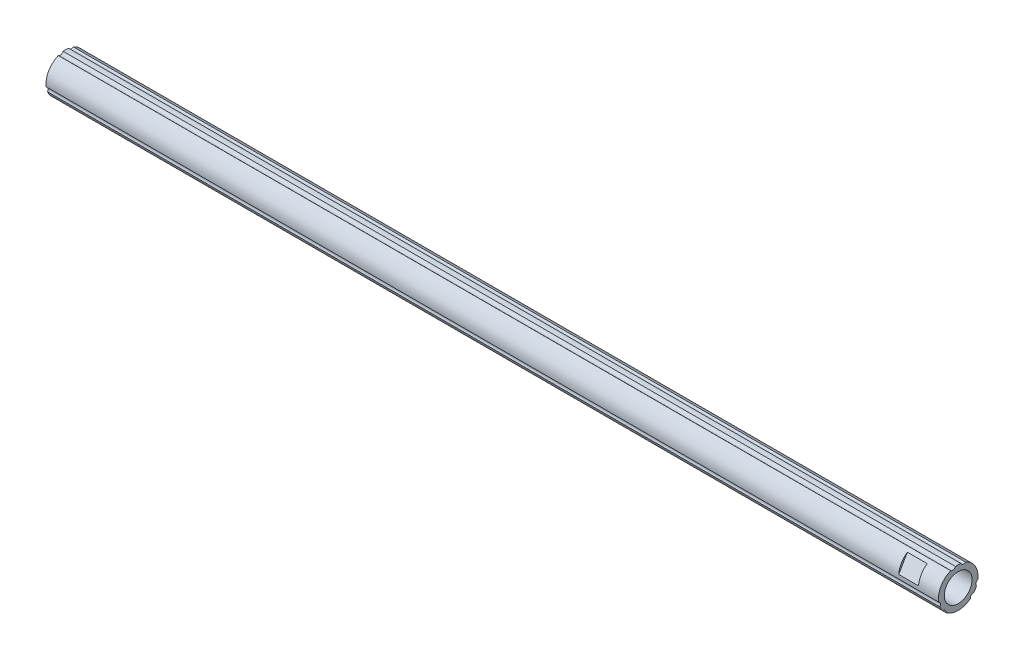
ISO-10303-21;
HEADER;
FILE_DESCRIPTION(('STEP AP214'),'2;1');
FILE_NAME('part.step','',(''),(''),'','','');
FILE_SCHEMA(('AUTOMOTIVE_DESIGN { 1 0 10303 214 1 1 1 1 }'));
ENDSEC;
DATA;
#1=APPLICATION_CONTEXT('core data for automotive mechanical design processes');
#2=APPLICATION_PROTOCOL_DEFINITION('international standard','automotive_design',2000,#1);
#3=PRODUCT_CONTEXT('',#1,'mechanical');
#4=PRODUCT('Part','Part','',(#3));
#5=PRODUCT_RELATED_PRODUCT_CATEGORY('part','',(#4));
#6=PRODUCT_DEFINITION_FORMATION('','',#4);
#7=PRODUCT_DEFINITION_CONTEXT('part definition',#1,'design');
#8=PRODUCT_DEFINITION('design','',#6,#7);
#9=PRODUCT_DEFINITION_SHAPE('','',#8);
#10=(LENGTH_UNIT() NAMED_UNIT(*) SI_UNIT(.MILLI.,.METRE.));
#11=(NAMED_UNIT(*) PLANE_ANGLE_UNIT() SI_UNIT($,.RADIAN.));
#12=(NAMED_UNIT(*) SI_UNIT($,.STERADIAN.) SOLID_ANGLE_UNIT());
#13=UNCERTAINTY_MEASURE_WITH_UNIT(LENGTH_MEASURE(1.E-05),#10,'distance_accuracy_value','');
#14=(GEOMETRIC_REPRESENTATION_CONTEXT(3) GLOBAL_UNCERTAINTY_ASSIGNED_CONTEXT((#13)) GLOBAL_UNIT_ASSIGNED_CONTEXT((#10,
#11,#12)) REPRESENTATION_CONTEXT('',''));
#15=CARTESIAN_POINT('',(0.,0.,0.));
#16=DIRECTION('',(0.,0.,1.));
#17=DIRECTION('',(1.,0.,0.));
#18=AXIS2_PLACEMENT_3D('',#15,#16,#17);
#19=CARTESIAN_POINT('',(233.143551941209,-11.7362954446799,450.));
#20=DIRECTION('',(-1.,0.,0.));
#21=DIRECTION('',(0.,0.,1.));
#22=AXIS2_PLACEMENT_3D('',#19,#20,#21);
#23=CYLINDRICAL_SURFACE('',#22,10.);
#24=DIRECTION('',(-1.,0.,0.));
#25=VECTOR('',#24,1.);
#26=CARTESIAN_POINT('',(233.143551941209,-2.47658612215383,453.775947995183));
#27=LINE('',#26,#25);
#28=CARTESIAN_POINT('',(233.143551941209,-2.47658612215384,453.775947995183));
#29=VERTEX_POINT('',#28);
#30=CARTESIAN_POINT('',(-216.856448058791,-2.47658612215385,453.775947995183));
#31=VERTEX_POINT('',#30);
#32=EDGE_CURVE('E250',#29,#31,#27,.T.);
#33=ORIENTED_EDGE('',*,*,#32,.T.);
#34=CARTESIAN_POINT('',(-216.856448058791,-11.7362954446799,450.));
#35=DIRECTION('',(1.,0.,0.));
#36=DIRECTION('',(0.,0.,-1.));
#37=AXIS2_PLACEMENT_3D('',#34,#35,#36);
#38=CIRCLE('',#37,10.);
#39=CARTESIAN_POINT('',(-216.856448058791,-13.0960832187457,459.907117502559));
#40=VERTEX_POINT('',#39);
#41=EDGE_CURVE('E233',#31,#40,#38,.T.);
#42=ORIENTED_EDGE('',*,*,#41,.T.);
#43=DIRECTION('',(1.,0.,0.));
#44=VECTOR('',#43,1.);
#45=CARTESIAN_POINT('',(233.143551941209,-13.0960832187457,459.907117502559));
#46=LINE('',#45,#44);
#47=CARTESIAN_POINT('',(233.143551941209,-13.0960832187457,459.907117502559));
#48=VERTEX_POINT('',#47);
#49=EDGE_CURVE('E96',#40,#48,#46,.T.);
#50=ORIENTED_EDGE('',*,*,#49,.T.);
#51=CARTESIAN_POINT('',(233.143551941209,-11.7362954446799,450.));
#52=DIRECTION('',(-1.,0.,0.));
#53=DIRECTION('',(0.,0.,1.));
#54=AXIS2_PLACEMENT_3D('',#51,#52,#53);
#55=CIRCLE('',#54,10.);
#56=EDGE_CURVE('E107',#48,#29,#55,.T.);
#57=ORIENTED_EDGE('',*,*,#56,.T.);
#58=EDGE_LOOP('',(#33,#42,#50,#57));
#59=FACE_BOUND('',#58,.T.);
#60=DIRECTION('',(-1.,0.,0.));
#61=VECTOR('',#60,1.);
#62=CARTESIAN_POINT('',(233.143551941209,-11.0112126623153,459.97367810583));
#63=LINE('',#62,#61);
#64=CARTESIAN_POINT('',(213.143551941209,-11.0112126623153,459.97367810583));
#65=VERTEX_POINT('',#64);
#66=CARTESIAN_POINT('',(223.143551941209,-11.0112126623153,459.97367810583));
#67=VERTEX_POINT('',#66);
#68=EDGE_CURVE('E26',#65,#67,#63,.F.);
#69=ORIENTED_EDGE('',*,*,#68,.F.);
#70=CARTESIAN_POINT('',(213.143551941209,-11.7362954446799,450.));
#71=DIRECTION('',(1.,0.,0.));
#72=DIRECTION('',(0.,0.,-1.));
#73=AXIS2_PLACEMENT_3D('',#70,#71,#72);
#74=CIRCLE('',#73,10.);
#75=CARTESIAN_POINT('',(213.143551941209,-3.46137822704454,455.61477916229));
#76=VERTEX_POINT('',#75);
#77=EDGE_CURVE('E11',#65,#76,#74,.F.);
#78=ORIENTED_EDGE('',*,*,#77,.T.);
#79=DIRECTION('',(-1.,0.,0.));
#80=VECTOR('',#79,1.);
#81=CARTESIAN_POINT('',(233.143551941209,-3.46137822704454,455.61477916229));
#82=LINE('',#81,#80);
#83=CARTESIAN_POINT('',(223.143551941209,-3.46137822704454,455.61477916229));
#84=VERTEX_POINT('',#83);
#85=EDGE_CURVE('E128',#84,#76,#82,.T.);
#86=ORIENTED_EDGE('',*,*,#85,.F.);
#87=CARTESIAN_POINT('',(223.143551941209,-11.7362954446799,450.));
#88=DIRECTION('',(1.,0.,0.));
#89=DIRECTION('',(0.,0.,-1.));
#90=AXIS2_PLACEMENT_3D('',#87,#88,#89);
#91=CIRCLE('',#90,10.);
#92=EDGE_CURVE('E125',#67,#84,#91,.F.);
#93=ORIENTED_EDGE('',*,*,#92,.F.);
#94=EDGE_LOOP('',(#69,#78,#86,#93));
#95=FACE_BOUND('',#94,.T.);
#96=ADVANCED_FACE('F17',(#59,#95),#23,.T.);
#97=CARTESIAN_POINT('',(233.143551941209,-1.20770393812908,452.821127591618));
#98=DIRECTION('',(1.,0.,0.));
#99=DIRECTION('',(0.,0.,-1.));
#100=AXIS2_PLACEMENT_3D('',#97,#98,#99);
#101=CYLINDRICAL_SURFACE('',#100,1.588);
#102=CARTESIAN_POINT('',(233.143551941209,-1.20770393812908,452.821127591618));
#103=DIRECTION('',(1.,0.,0.));
#104=DIRECTION('',(0.,0.,-1.));
#105=AXIS2_PLACEMENT_3D('',#102,#103,#104);
#106=CIRCLE('',#105,1.588);
#107=CARTESIAN_POINT('',(233.143551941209,-1.82917794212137,451.359787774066));
#108=VERTEX_POINT('',#107);
#109=EDGE_CURVE('E300',#29,#108,#106,.T.);
#110=ORIENTED_EDGE('',*,*,#109,.T.);
#111=DIRECTION('',(-1.,0.,0.));
#112=VECTOR('',#111,1.);
#113=CARTESIAN_POINT('',(233.143551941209,-1.82917794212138,451.359787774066));
#114=LINE('',#113,#112);
#115=CARTESIAN_POINT('',(-216.856448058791,-1.82917794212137,451.359787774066));
#116=VERTEX_POINT('',#115);
#117=EDGE_CURVE('E121',#116,#108,#114,.F.);
#118=ORIENTED_EDGE('',*,*,#117,.F.);
#119=CARTESIAN_POINT('',(-216.856448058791,-1.20770393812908,452.821127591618));
#120=DIRECTION('',(1.,0.,0.));
#121=DIRECTION('',(0.,0.,-1.));
#122=AXIS2_PLACEMENT_3D('',#119,#120,#121);
#123=CIRCLE('',#122,1.588);
#124=EDGE_CURVE('E237',#116,#31,#123,.F.);
#125=ORIENTED_EDGE('',*,*,#124,.T.);
#126=ORIENTED_EDGE('',*,*,#32,.F.);
#127=EDGE_LOOP('',(#110,#118,#125,#126));
#128=FACE_BOUND('',#127,.T.);
#129=ADVANCED_FACE('F19',(#128),#101,.F.);
#130=CARTESIAN_POINT('',(233.143551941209,-14.5574230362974,460.528591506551));
#131=DIRECTION('',(1.,0.,0.));
#132=DIRECTION('',(0.,0.,-1.));
#133=AXIS2_PLACEMENT_3D('',#130,#131,#132);
#134=CYLINDRICAL_SURFACE('',#133,1.588);
#135=CARTESIAN_POINT('',(233.143551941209,-14.5574230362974,460.528591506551));
#136=DIRECTION('',(1.,0.,0.));
#137=DIRECTION('',(0.,0.,-1.));
#138=AXIS2_PLACEMENT_3D('',#135,#136,#137);
#139=CIRCLE('',#138,1.588);
#140=CARTESIAN_POINT('',(233.143551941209,-15.5122434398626,459.259709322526));
#141=VERTEX_POINT('',#140);
#142=EDGE_CURVE('E86',#141,#48,#139,.T.);
#143=ORIENTED_EDGE('',*,*,#142,.T.);
#144=ORIENTED_EDGE('',*,*,#49,.F.);
#145=CARTESIAN_POINT('',(-216.856448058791,-14.5574230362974,460.528591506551));
#146=DIRECTION('',(1.,0.,0.));
#147=DIRECTION('',(0.,0.,-1.));
#148=AXIS2_PLACEMENT_3D('',#145,#146,#147);
#149=CIRCLE('',#148,1.588);
#150=CARTESIAN_POINT('',(-216.856448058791,-15.5122434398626,459.259709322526));
#151=VERTEX_POINT('',#150);
#152=EDGE_CURVE('E89',#40,#151,#149,.F.);
#153=ORIENTED_EDGE('',*,*,#152,.T.);
#154=DIRECTION('',(-1.,0.,0.));
#155=VECTOR('',#154,1.);
#156=CARTESIAN_POINT('',(233.143551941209,-15.5122434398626,459.259709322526));
#157=LINE('',#156,#155);
#158=EDGE_CURVE('E82',#141,#151,#157,.T.);
#159=ORIENTED_EDGE('',*,*,#158,.F.);
#160=EDGE_LOOP('',(#143,#144,#153,#159));
#161=FACE_BOUND('',#160,.T.);
#162=ADVANCED_FACE('F84',(#161),#134,.F.);
#163=CARTESIAN_POINT('',(233.143551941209,-11.7362954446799,450.));
#164=DIRECTION('',(-1.,0.,0.));
#165=DIRECTION('',(0.,0.,1.));
#166=AXIS2_PLACEMENT_3D('',#163,#164,#165);
#167=CYLINDRICAL_SURFACE('',#166,10.);
#168=ORIENTED_EDGE('',*,*,#158,.T.);
#169=CARTESIAN_POINT('',(-216.856448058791,-11.7362954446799,450.));
#170=DIRECTION('',(1.,0.,0.));
#171=DIRECTION('',(0.,0.,-1.));
#172=AXIS2_PLACEMENT_3D('',#169,#170,#171);
#173=CIRCLE('',#172,10.);
#174=CARTESIAN_POINT('',(-216.856448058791,-17.8674649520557,457.89992154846));
#175=VERTEX_POINT('',#174);
#176=EDGE_CURVE('E228',#151,#175,#173,.T.);
#177=ORIENTED_EDGE('',*,*,#176,.T.);
#178=DIRECTION('',(1.,0.,0.));
#179=VECTOR('',#178,1.);
#180=CARTESIAN_POINT('',(233.143551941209,-17.8674649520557,457.89992154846));
#181=LINE('',#180,#179);
#182=CARTESIAN_POINT('',(233.143551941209,-17.8674649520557,457.89992154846));
#183=VERTEX_POINT('',#182);
#184=EDGE_CURVE('E95',#175,#183,#181,.T.);
#185=ORIENTED_EDGE('',*,*,#184,.T.);
#186=CARTESIAN_POINT('',(233.143551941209,-11.7362954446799,450.));
#187=DIRECTION('',(-1.,0.,0.));
#188=DIRECTION('',(0.,0.,1.));
#189=AXIS2_PLACEMENT_3D('',#186,#187,#188);
#190=CIRCLE('',#189,10.);
#191=EDGE_CURVE('E103',#183,#141,#190,.T.);
#192=ORIENTED_EDGE('',*,*,#191,.T.);
#193=EDGE_LOOP('',(#168,#177,#185,#192));
#194=FACE_BOUND('',#193,.T.);
#195=ADVANCED_FACE('F110',(#194),#167,.T.);
#196=CARTESIAN_POINT('',(233.143551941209,-19.4437593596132,457.707463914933));
#197=DIRECTION('',(1.,0.,0.));
#198=DIRECTION('',(0.,0.,-1.));
#199=AXIS2_PLACEMENT_3D('',#196,#197,#198);
#200=CYLINDRICAL_SURFACE('',#199,1.588);
#201=CARTESIAN_POINT('',(233.143551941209,-19.4437593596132,457.707463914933));
#202=DIRECTION('',(1.,0.,0.));
#203=DIRECTION('',(0.,0.,-1.));
#204=AXIS2_PLACEMENT_3D('',#201,#202,#203);
#205=CIRCLE('',#204,1.588);
#206=CARTESIAN_POINT('',(233.143551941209,-19.63621699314,456.131169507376));
#207=VERTEX_POINT('',#206);
#208=EDGE_CURVE('E273',#207,#183,#205,.T.);
#209=ORIENTED_EDGE('',*,*,#208,.T.);
#210=ORIENTED_EDGE('',*,*,#184,.F.);
#211=CARTESIAN_POINT('',(-216.856448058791,-19.4437593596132,457.707463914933));
#212=DIRECTION('',(1.,0.,0.));
#213=DIRECTION('',(0.,0.,-1.));
#214=AXIS2_PLACEMENT_3D('',#211,#212,#213);
#215=CIRCLE('',#214,1.588);
#216=CARTESIAN_POINT('',(-216.856448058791,-19.63621699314,456.131169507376));
#217=VERTEX_POINT('',#216);
#218=EDGE_CURVE('E225',#175,#217,#215,.F.);
#219=ORIENTED_EDGE('',*,*,#218,.T.);
#220=DIRECTION('',(-1.,0.,0.));
#221=VECTOR('',#220,1.);
#222=CARTESIAN_POINT('',(233.143551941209,-19.63621699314,456.131169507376));
#223=LINE('',#222,#221);
#224=EDGE_CURVE('E41',#207,#217,#223,.T.);
#225=ORIENTED_EDGE('',*,*,#224,.F.);
#226=EDGE_LOOP('',(#209,#210,#219,#225));
#227=FACE_BOUND('',#226,.T.);
#228=ADVANCED_FACE('F310',(#227),#200,.F.);
#229=CARTESIAN_POINT('',(233.143551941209,-11.7362954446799,450.));
#230=DIRECTION('',(-1.,0.,0.));
#231=DIRECTION('',(0.,0.,1.));
#232=AXIS2_PLACEMENT_3D('',#229,#230,#231);
#233=CYLINDRICAL_SURFACE('',#232,10.);
#234=DIRECTION('',(1.,0.,0.));
#235=VECTOR('',#234,1.);
#236=CARTESIAN_POINT('',(233.143551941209,-19.63621699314,443.868830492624));
#237=LINE('',#236,#235);
#238=CARTESIAN_POINT('',(-216.856448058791,-19.63621699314,443.868830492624));
#239=VERTEX_POINT('',#238);
#240=CARTESIAN_POINT('',(233.143551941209,-19.63621699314,443.868830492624));
#241=VERTEX_POINT('',#240);
#242=EDGE_CURVE('E260',#239,#241,#237,.T.);
#243=ORIENTED_EDGE('',*,*,#242,.T.);
#244=CARTESIAN_POINT('',(233.143551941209,-11.7362954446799,450.));
#245=DIRECTION('',(-1.,0.,0.));
#246=DIRECTION('',(0.,0.,1.));
#247=AXIS2_PLACEMENT_3D('',#244,#245,#246);
#248=CIRCLE('',#247,10.);
#249=EDGE_CURVE('E276',#241,#207,#248,.T.);
#250=ORIENTED_EDGE('',*,*,#249,.T.);
#251=ORIENTED_EDGE('',*,*,#224,.T.);
#252=CARTESIAN_POINT('',(-216.856448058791,-11.7362954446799,450.));
#253=DIRECTION('',(1.,0.,0.));
#254=DIRECTION('',(0.,0.,-1.));
#255=AXIS2_PLACEMENT_3D('',#252,#253,#254);
#256=CIRCLE('',#255,10.);
#257=EDGE_CURVE('E221',#217,#239,#256,.T.);
#258=ORIENTED_EDGE('',*,*,#257,.T.);
#259=EDGE_LOOP('',(#243,#250,#251,#258));
#260=FACE_BOUND('',#259,.T.);
#261=ADVANCED_FACE('F313',(#260),#233,.T.);
#262=CARTESIAN_POINT('',(233.143551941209,-19.4437593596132,442.292536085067));
#263=DIRECTION('',(1.,0.,0.));
#264=DIRECTION('',(0.,0.,-1.));
#265=AXIS2_PLACEMENT_3D('',#262,#263,#264);
#266=CYLINDRICAL_SURFACE('',#265,1.588);
#267=CARTESIAN_POINT('',(233.143551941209,-19.4437593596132,442.292536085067));
#268=DIRECTION('',(1.,0.,0.));
#269=DIRECTION('',(0.,0.,-1.));
#270=AXIS2_PLACEMENT_3D('',#267,#268,#269);
#271=CIRCLE('',#270,1.588);
#272=CARTESIAN_POINT('',(233.143551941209,-17.8674649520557,442.10007845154));
#273=VERTEX_POINT('',#272);
#274=EDGE_CURVE('E280',#273,#241,#271,.T.);
#275=ORIENTED_EDGE('',*,*,#274,.T.);
#276=ORIENTED_EDGE('',*,*,#242,.F.);
#277=CARTESIAN_POINT('',(-216.856448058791,-19.4437593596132,442.292536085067));
#278=DIRECTION('',(1.,0.,0.));
#279=DIRECTION('',(0.,0.,-1.));
#280=AXIS2_PLACEMENT_3D('',#277,#278,#279);
#281=CIRCLE('',#280,1.588);
#282=CARTESIAN_POINT('',(-216.856448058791,-17.8674649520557,442.10007845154));
#283=VERTEX_POINT('',#282);
#284=EDGE_CURVE('E215',#239,#283,#281,.F.);
#285=ORIENTED_EDGE('',*,*,#284,.T.);
#286=DIRECTION('',(-1.,0.,0.));
#287=VECTOR('',#286,1.);
#288=CARTESIAN_POINT('',(233.143551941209,-17.8674649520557,442.10007845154));
#289=LINE('',#288,#287);
#290=EDGE_CURVE('E258',#273,#283,#289,.T.);
#291=ORIENTED_EDGE('',*,*,#290,.F.);
#292=EDGE_LOOP('',(#275,#276,#285,#291));
#293=FACE_BOUND('',#292,.T.);
#294=ADVANCED_FACE('F315',(#293),#266,.F.);
#295=CARTESIAN_POINT('',(233.143551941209,-11.7362954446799,450.));
#296=DIRECTION('',(-1.,0.,0.));
#297=DIRECTION('',(0.,0.,1.));
#298=AXIS2_PLACEMENT_3D('',#295,#296,#297);
#299=CYLINDRICAL_SURFACE('',#298,10.);
#300=DIRECTION('',(1.,0.,0.));
#301=VECTOR('',#300,1.);
#302=CARTESIAN_POINT('',(233.143551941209,-15.5122434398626,440.740290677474));
#303=LINE('',#302,#301);
#304=CARTESIAN_POINT('',(-216.856448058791,-15.5122434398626,440.740290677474));
#305=VERTEX_POINT('',#304);
#306=CARTESIAN_POINT('',(233.143551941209,-15.5122434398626,440.740290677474));
#307=VERTEX_POINT('',#306);
#308=EDGE_CURVE('E193',#305,#307,#303,.T.);
#309=ORIENTED_EDGE('',*,*,#308,.T.);
#310=CARTESIAN_POINT('',(233.143551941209,-11.7362954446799,450.));
#311=DIRECTION('',(-1.,0.,0.));
#312=DIRECTION('',(0.,0.,1.));
#313=AXIS2_PLACEMENT_3D('',#310,#311,#312);
#314=CIRCLE('',#313,10.);
#315=EDGE_CURVE('E284',#307,#273,#314,.T.);
#316=ORIENTED_EDGE('',*,*,#315,.T.);
#317=ORIENTED_EDGE('',*,*,#290,.T.);
#318=CARTESIAN_POINT('',(-216.856448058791,-11.7362954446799,450.));
#319=DIRECTION('',(1.,0.,0.));
#320=DIRECTION('',(0.,0.,-1.));
#321=AXIS2_PLACEMENT_3D('',#318,#319,#320);
#322=CIRCLE('',#321,10.);
#323=EDGE_CURVE('E209',#283,#305,#322,.T.);
#324=ORIENTED_EDGE('',*,*,#323,.T.);
#325=EDGE_LOOP('',(#309,#316,#317,#324));
#326=FACE_BOUND('',#325,.T.);
#327=ADVANCED_FACE('F317',(#326),#299,.T.);
#328=CARTESIAN_POINT('',(233.143551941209,-14.5574230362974,439.47140849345));
#329=DIRECTION('',(1.,0.,0.));
#330=DIRECTION('',(0.,0.,-1.));
#331=AXIS2_PLACEMENT_3D('',#328,#329,#330);
#332=CYLINDRICAL_SURFACE('',#331,1.588);
#333=CARTESIAN_POINT('',(233.143551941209,-14.5574230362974,439.47140849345));
#334=DIRECTION('',(1.,0.,0.));
#335=DIRECTION('',(0.,0.,-1.));
#336=AXIS2_PLACEMENT_3D('',#333,#334,#335);
#337=CIRCLE('',#336,1.588);
#338=CARTESIAN_POINT('',(233.143551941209,-13.0960832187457,440.092882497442));
#339=VERTEX_POINT('',#338);
#340=EDGE_CURVE('E287',#339,#307,#337,.T.);
#341=ORIENTED_EDGE('',*,*,#340,.T.);
#342=ORIENTED_EDGE('',*,*,#308,.F.);
#343=CARTESIAN_POINT('',(-216.856448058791,-14.5574230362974,439.47140849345));
#344=DIRECTION('',(1.,0.,0.));
#345=DIRECTION('',(0.,0.,-1.));
#346=AXIS2_PLACEMENT_3D('',#343,#344,#345);
#347=CIRCLE('',#346,1.588);
#348=CARTESIAN_POINT('',(-216.856448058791,-13.0960832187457,440.092882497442));
#349=VERTEX_POINT('',#348);
#350=EDGE_CURVE('E200',#305,#349,#347,.F.);
#351=ORIENTED_EDGE('',*,*,#350,.T.);
#352=DIRECTION('',(-1.,0.,0.));
#353=VECTOR('',#352,1.);
#354=CARTESIAN_POINT('',(233.143551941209,-13.0960832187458,440.092882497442));
#355=LINE('',#354,#353);
#356=EDGE_CURVE('E182',#339,#349,#355,.T.);
#357=ORIENTED_EDGE('',*,*,#356,.F.);
#358=EDGE_LOOP('',(#341,#342,#351,#357));
#359=FACE_BOUND('',#358,.T.);
#360=ADVANCED_FACE('F207',(#359),#332,.F.);
#361=CARTESIAN_POINT('',(233.143551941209,-11.7362954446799,450.));
#362=DIRECTION('',(-1.,0.,0.));
#363=DIRECTION('',(0.,0.,1.));
#364=AXIS2_PLACEMENT_3D('',#361,#362,#363);
#365=CYLINDRICAL_SURFACE('',#364,10.);
#366=DIRECTION('',(1.,0.,0.));
#367=VECTOR('',#366,1.);
#368=CARTESIAN_POINT('',(233.143551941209,-2.47658612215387,446.224052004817));
#369=LINE('',#368,#367);
#370=CARTESIAN_POINT('',(-216.856448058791,-2.47658612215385,446.224052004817));
#371=VERTEX_POINT('',#370);
#372=CARTESIAN_POINT('',(233.143551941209,-2.47658612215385,446.224052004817));
#373=VERTEX_POINT('',#372);
#374=EDGE_CURVE('E192',#371,#373,#369,.T.);
#375=ORIENTED_EDGE('',*,*,#374,.T.);
#376=CARTESIAN_POINT('',(233.143551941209,-11.7362954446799,450.));
#377=DIRECTION('',(-1.,0.,0.));
#378=DIRECTION('',(0.,0.,1.));
#379=AXIS2_PLACEMENT_3D('',#376,#377,#378);
#380=CIRCLE('',#379,10.);
#381=EDGE_CURVE('E187',#373,#339,#380,.T.);
#382=ORIENTED_EDGE('',*,*,#381,.T.);
#383=ORIENTED_EDGE('',*,*,#356,.T.);
#384=CARTESIAN_POINT('',(-216.856448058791,-11.7362954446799,450.));
#385=DIRECTION('',(1.,0.,0.));
#386=DIRECTION('',(0.,0.,-1.));
#387=AXIS2_PLACEMENT_3D('',#384,#385,#386);
#388=CIRCLE('',#387,10.);
#389=EDGE_CURVE('E185',#349,#371,#388,.T.);
#390=ORIENTED_EDGE('',*,*,#389,.T.);
#391=EDGE_LOOP('',(#375,#382,#383,#390));
#392=FACE_BOUND('',#391,.T.);
#393=ADVANCED_FACE('F184',(#392),#365,.T.);
#394=CARTESIAN_POINT('',(233.143551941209,-1.20770393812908,447.178872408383));
#395=DIRECTION('',(1.,0.,0.));
#396=DIRECTION('',(0.,0.,-1.));
#397=AXIS2_PLACEMENT_3D('',#394,#395,#396);
#398=CYLINDRICAL_SURFACE('',#397,1.588);
#399=CARTESIAN_POINT('',(233.143551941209,-1.20770393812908,447.178872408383));
#400=DIRECTION('',(1.,0.,0.));
#401=DIRECTION('',(0.,0.,-1.));
#402=AXIS2_PLACEMENT_3D('',#399,#400,#401);
#403=CIRCLE('',#402,1.588);
#404=CARTESIAN_POINT('',(233.143551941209,-1.82917794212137,448.640212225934));
#405=VERTEX_POINT('',#404);
#406=EDGE_CURVE('E292',#405,#373,#403,.T.);
#407=ORIENTED_EDGE('',*,*,#406,.T.);
#408=ORIENTED_EDGE('',*,*,#374,.F.);
#409=CARTESIAN_POINT('',(-216.856448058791,-1.20770393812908,447.178872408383));
#410=DIRECTION('',(1.,0.,0.));
#411=DIRECTION('',(0.,0.,-1.));
#412=AXIS2_PLACEMENT_3D('',#409,#410,#411);
#413=CIRCLE('',#412,1.588);
#414=CARTESIAN_POINT('',(-216.856448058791,-1.82917794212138,448.640212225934));
#415=VERTEX_POINT('',#414);
#416=EDGE_CURVE('E204',#371,#415,#413,.F.);
#417=ORIENTED_EDGE('',*,*,#416,.T.);
#418=DIRECTION('',(-1.,0.,0.));
#419=VECTOR('',#418,1.);
#420=CARTESIAN_POINT('',(233.143551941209,-1.82917794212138,448.640212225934));
#421=LINE('',#420,#419);
#422=EDGE_CURVE('E113',#405,#415,#421,.T.);
#423=ORIENTED_EDGE('',*,*,#422,.F.);
#424=EDGE_LOOP('',(#407,#408,#417,#423));
#425=FACE_BOUND('',#424,.T.);
#426=ADVANCED_FACE('F322',(#425),#398,.F.);
#427=CARTESIAN_POINT('',(233.143551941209,-11.7362954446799,450.));
#428=DIRECTION('',(-1.,0.,0.));
#429=DIRECTION('',(0.,0.,1.));
#430=AXIS2_PLACEMENT_3D('',#427,#428,#429);
#431=CYLINDRICAL_SURFACE('',#430,10.);
#432=ORIENTED_EDGE('',*,*,#422,.T.);
#433=CARTESIAN_POINT('',(-216.856448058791,-11.7362954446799,450.));
#434=DIRECTION('',(1.,0.,0.));
#435=DIRECTION('',(0.,0.,-1.));
#436=AXIS2_PLACEMENT_3D('',#433,#434,#435);
#437=CIRCLE('',#436,10.);
#438=EDGE_CURVE('E241',#415,#116,#437,.T.);
#439=ORIENTED_EDGE('',*,*,#438,.T.);
#440=ORIENTED_EDGE('',*,*,#117,.T.);
#441=CARTESIAN_POINT('',(233.143551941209,-11.7362954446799,450.));
#442=DIRECTION('',(-1.,0.,0.));
#443=DIRECTION('',(0.,0.,1.));
#444=AXIS2_PLACEMENT_3D('',#441,#442,#443);
#445=CIRCLE('',#444,10.);
#446=EDGE_CURVE('E296',#108,#405,#445,.T.);
#447=ORIENTED_EDGE('',*,*,#446,.T.);
#448=EDGE_LOOP('',(#432,#439,#440,#447));
#449=FACE_BOUND('',#448,.T.);
#450=ADVANCED_FACE('F324',(#449),#431,.T.);
#451=CARTESIAN_POINT('',(233.143551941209,-1.73629544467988,450.));
#452=DIRECTION('',(-1.,0.,0.));
#453=DIRECTION('',(0.,0.,1.));
#454=AXIS2_PLACEMENT_3D('',#451,#452,#453);
#455=PLANE('',#454);
#456=ORIENTED_EDGE('',*,*,#249,.F.);
#457=ORIENTED_EDGE('',*,*,#274,.F.);
#458=ORIENTED_EDGE('',*,*,#315,.F.);
#459=ORIENTED_EDGE('',*,*,#340,.F.);
#460=ORIENTED_EDGE('',*,*,#381,.F.);
#461=ORIENTED_EDGE('',*,*,#406,.F.);
#462=ORIENTED_EDGE('',*,*,#446,.F.);
#463=ORIENTED_EDGE('',*,*,#109,.F.);
#464=ORIENTED_EDGE('',*,*,#56,.F.);
#465=ORIENTED_EDGE('',*,*,#142,.F.);
#466=ORIENTED_EDGE('',*,*,#191,.F.);
#467=ORIENTED_EDGE('',*,*,#208,.F.);
#468=EDGE_LOOP('',(#456,#457,#458,#459,#460,#461,#462,#463,#464,#465,#466,#467));
#469=FACE_BOUND('',#468,.T.);
#470=CARTESIAN_POINT('',(233.143551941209,-11.7362954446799,450.));
#471=DIRECTION('',(-1.,0.,0.));
#472=DIRECTION('',(0.,0.,1.));
#473=AXIS2_PLACEMENT_3D('',#470,#471,#472);
#474=CIRCLE('',#473,7.);
#475=CARTESIAN_POINT('',(233.143551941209,-11.7362954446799,457.));
#476=VERTEX_POINT('',#475);
#477=EDGE_CURVE('E129',#476,#476,#474,.T.);
#478=ORIENTED_EDGE('',*,*,#477,.T.);
#479=EDGE_LOOP('',(#478));
#480=FACE_BOUND('',#479,.T.);
#481=ADVANCED_FACE('F101',(#469,#480),#455,.F.);
#482=CARTESIAN_POINT('',(233.143551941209,-11.7362954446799,450.));
#483=DIRECTION('',(-1.,0.,0.));
#484=DIRECTION('',(0.,0.,1.));
#485=AXIS2_PLACEMENT_3D('',#482,#483,#484);
#486=CYLINDRICAL_SURFACE('',#485,7.);
#487=ORIENTED_EDGE('',*,*,#477,.F.);
#488=EDGE_LOOP('',(#487));
#489=FACE_BOUND('',#488,.T.);
#490=CARTESIAN_POINT('',(-216.856448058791,-11.7362954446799,450.));
#491=DIRECTION('',(1.,0.,0.));
#492=DIRECTION('',(0.,0.,-1.));
#493=AXIS2_PLACEMENT_3D('',#490,#491,#492);
#494=CIRCLE('',#493,7.);
#495=CARTESIAN_POINT('',(-216.856448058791,-11.7362954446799,443.));
#496=VERTEX_POINT('',#495);
#497=EDGE_CURVE('E247',#496,#496,#494,.T.);
#498=ORIENTED_EDGE('',*,*,#497,.F.);
#499=EDGE_LOOP('',(#498));
#500=FACE_BOUND('',#499,.T.);
#501=ADVANCED_FACE('F333',(#489,#500),#486,.F.);
#502=CARTESIAN_POINT('',(-216.856448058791,-11.7362954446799,450.));
#503=DIRECTION('',(1.,0.,0.));
#504=DIRECTION('',(0.,0.,-1.));
#505=AXIS2_PLACEMENT_3D('',#502,#503,#504);
#506=PLANE('',#505);
#507=ORIENTED_EDGE('',*,*,#497,.T.);
#508=EDGE_LOOP('',(#507));
#509=FACE_BOUND('',#508,.T.);
#510=ORIENTED_EDGE('',*,*,#350,.F.);
#511=ORIENTED_EDGE('',*,*,#323,.F.);
#512=ORIENTED_EDGE('',*,*,#284,.F.);
#513=ORIENTED_EDGE('',*,*,#257,.F.);
#514=ORIENTED_EDGE('',*,*,#218,.F.);
#515=ORIENTED_EDGE('',*,*,#176,.F.);
#516=ORIENTED_EDGE('',*,*,#152,.F.);
#517=ORIENTED_EDGE('',*,*,#41,.F.);
#518=ORIENTED_EDGE('',*,*,#124,.F.);
#519=ORIENTED_EDGE('',*,*,#438,.F.);
#520=ORIENTED_EDGE('',*,*,#416,.F.);
#521=ORIENTED_EDGE('',*,*,#389,.F.);
#522=EDGE_LOOP('',(#510,#511,#512,#513,#514,#515,#516,#517,#518,#519,#520,#521));
#523=FACE_BOUND('',#522,.T.);
#524=ADVANCED_FACE('F198',(#509,#523),#506,.F.);
#525=CARTESIAN_POINT('',(213.143551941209,-3.41354542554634,455.587162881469));
#526=DIRECTION('',(0.,-0.5,-0.866025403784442));
#527=DIRECTION('',(0.,0.866025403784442,-0.5));
#528=AXIS2_PLACEMENT_3D('',#525,#526,#527);
#529=PLANE('',#528);
#530=ORIENTED_EDGE('',*,*,#68,.T.);
#531=DIRECTION('',(0.,0.866025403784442,-0.5));
#532=VECTOR('',#531,1.);
#533=CARTESIAN_POINT('',(223.143551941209,-3.41354542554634,455.587162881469));
#534=LINE('',#533,#532);
#535=EDGE_CURVE('E32',#67,#84,#534,.T.);
#536=ORIENTED_EDGE('',*,*,#535,.T.);
#537=ORIENTED_EDGE('',*,*,#85,.T.);
#538=DIRECTION('',(0.,0.866025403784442,-0.5));
#539=VECTOR('',#538,1.);
#540=CARTESIAN_POINT('',(213.143551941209,-3.41354542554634,455.587162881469));
#541=LINE('',#540,#539);
#542=EDGE_CURVE('E145',#65,#76,#541,.T.);
#543=ORIENTED_EDGE('',*,*,#542,.F.);
#544=EDGE_LOOP('',(#530,#536,#537,#543));
#545=FACE_BOUND('',#544,.T.);
#546=ADVANCED_FACE('F140',(#545),#529,.F.);
#547=CARTESIAN_POINT('',(213.143551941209,-11.7362954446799,450.));
#548=DIRECTION('',(1.,0.,0.));
#549=DIRECTION('',(0.,0.,-1.));
#550=AXIS2_PLACEMENT_3D('',#547,#548,#549);
#551=PLANE('',#550);
#552=ORIENTED_EDGE('',*,*,#542,.T.);
#553=ORIENTED_EDGE('',*,*,#77,.F.);
#554=EDGE_LOOP('',(#552,#553));
#555=FACE_BOUND('',#554,.T.);
#556=ADVANCED_FACE('F341',(#555),#551,.T.);
#557=CARTESIAN_POINT('',(223.143551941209,-11.7362954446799,450.));
#558=DIRECTION('',(1.,0.,0.));
#559=DIRECTION('',(0.,0.,-1.));
#560=AXIS2_PLACEMENT_3D('',#557,#558,#559);
#561=PLANE('',#560);
#562=ORIENTED_EDGE('',*,*,#92,.T.);
#563=ORIENTED_EDGE('',*,*,#535,.F.);
#564=EDGE_LOOP('',(#562,#563));
#565=FACE_BOUND('',#564,.T.);
#566=ADVANCED_FACE('F147',(#565),#561,.F.);
#567=CLOSED_SHELL('',(#96,#129,#162,#195,#228,#261,#294,#327,#360,#393,#426,#450,#481,#501,#524,
#546,#556,#566));
#568=MANIFOLD_SOLID_BREP('B1',#567);
#569=ADVANCED_BREP_SHAPE_REPRESENTATION('',(#18,#568),#14);
#570=SHAPE_DEFINITION_REPRESENTATION(#9,#569);
ENDSEC;
END-ISO-10303-21;
